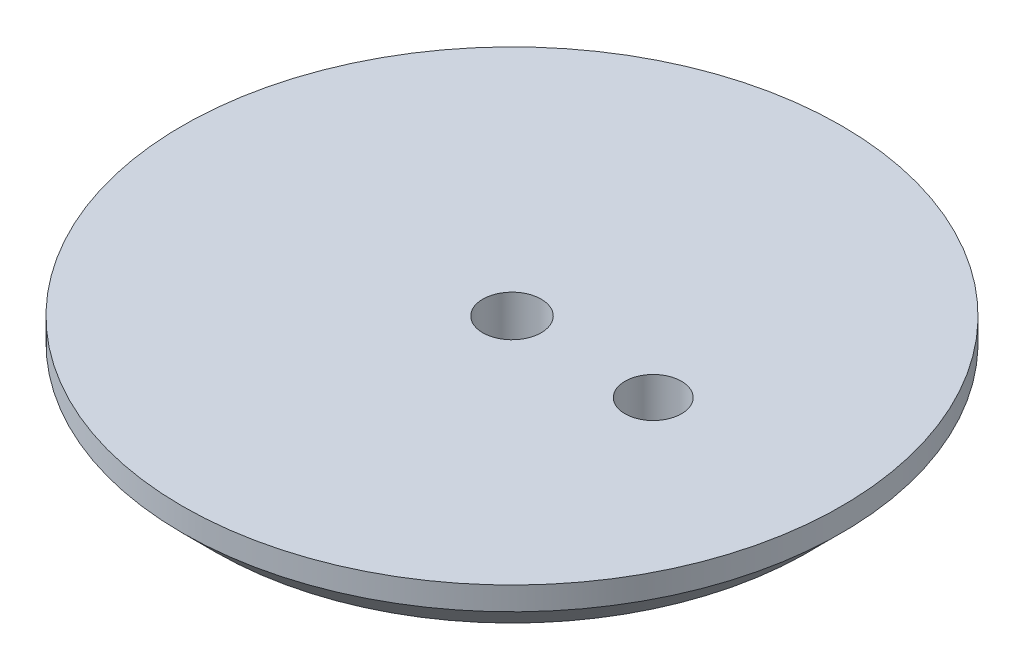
ISO-10303-21;
HEADER;
FILE_DESCRIPTION(('STEP AP214'),'2;1');
FILE_NAME('part.step','',(''),(''),'','','');
FILE_SCHEMA(('AUTOMOTIVE_DESIGN { 1 0 10303 214 1 1 1 1 }'));
ENDSEC;
DATA;
#1=APPLICATION_CONTEXT('core data for automotive mechanical design processes');
#2=APPLICATION_PROTOCOL_DEFINITION('international standard','automotive_design',2000,#1);
#3=PRODUCT_CONTEXT('',#1,'mechanical');
#4=PRODUCT('Part','Part','',(#3));
#5=PRODUCT_RELATED_PRODUCT_CATEGORY('part','',(#4));
#6=PRODUCT_DEFINITION_FORMATION('','',#4);
#7=PRODUCT_DEFINITION_CONTEXT('part definition',#1,'design');
#8=PRODUCT_DEFINITION('design','',#6,#7);
#9=PRODUCT_DEFINITION_SHAPE('','',#8);
#10=(LENGTH_UNIT() NAMED_UNIT(*) SI_UNIT(.MILLI.,.METRE.));
#11=(NAMED_UNIT(*) PLANE_ANGLE_UNIT() SI_UNIT($,.RADIAN.));
#12=(NAMED_UNIT(*) SI_UNIT($,.STERADIAN.) SOLID_ANGLE_UNIT());
#13=UNCERTAINTY_MEASURE_WITH_UNIT(LENGTH_MEASURE(1.E-05),#10,'distance_accuracy_value','');
#14=(GEOMETRIC_REPRESENTATION_CONTEXT(3) GLOBAL_UNCERTAINTY_ASSIGNED_CONTEXT((#13)) GLOBAL_UNIT_ASSIGNED_CONTEXT((#10,
#11,#12)) REPRESENTATION_CONTEXT('',''));
#15=CARTESIAN_POINT('',(0.,0.,0.));
#16=DIRECTION('',(0.,0.,1.));
#17=DIRECTION('',(1.,0.,0.));
#18=AXIS2_PLACEMENT_3D('',#15,#16,#17);
#19=CARTESIAN_POINT('',(0.,0.,0.));
#20=DIRECTION('',(0.,1.,0.));
#21=DIRECTION('',(0.,0.,1.));
#22=AXIS2_PLACEMENT_3D('',#19,#20,#21);
#23=PLANE('',#22);
#24=CARTESIAN_POINT('',(15.,0.,0.));
#25=DIRECTION('',(0.,1.,0.));
#26=DIRECTION('',(0.,0.,1.));
#27=AXIS2_PLACEMENT_3D('',#24,#25,#26);
#28=CIRCLE('',#27,3.);
#29=CARTESIAN_POINT('',(15.,0.,3.));
#30=VERTEX_POINT('',#29);
#31=EDGE_CURVE('E47',#30,#30,#28,.T.);
#32=ORIENTED_EDGE('',*,*,#31,.T.);
#33=EDGE_LOOP('',(#32));
#34=FACE_BOUND('',#33,.T.);
#35=CARTESIAN_POINT('',(0.,0.,0.));
#36=DIRECTION('',(0.,1.,0.));
#37=DIRECTION('',(0.,0.,1.));
#38=AXIS2_PLACEMENT_3D('',#35,#36,#37);
#39=CIRCLE('',#38,3.1);
#40=CARTESIAN_POINT('',(0.,0.,3.1));
#41=VERTEX_POINT('',#40);
#42=EDGE_CURVE('E39',#41,#41,#39,.T.);
#43=ORIENTED_EDGE('',*,*,#42,.T.);
#44=EDGE_LOOP('',(#43));
#45=FACE_BOUND('',#44,.T.);
#46=CARTESIAN_POINT('',(0.,0.,0.));
#47=DIRECTION('',(0.,1.,0.));
#48=DIRECTION('',(0.,0.,1.));
#49=AXIS2_PLACEMENT_3D('',#46,#47,#48);
#50=CIRCLE('',#49,31.4644660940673);
#51=CARTESIAN_POINT('',(0.,0.,31.4644660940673));
#52=VERTEX_POINT('',#51);
#53=EDGE_CURVE('E10',#52,#52,#50,.T.);
#54=ORIENTED_EDGE('',*,*,#53,.F.);
#55=EDGE_LOOP('',(#54));
#56=FACE_BOUND('',#55,.T.);
#57=ADVANCED_FACE('F25',(#34,#45,#56),#23,.F.);
#58=CARTESIAN_POINT('',(0.,0.,0.));
#59=DIRECTION('',(0.,1.,0.));
#60=DIRECTION('',(0.,0.,1.));
#61=AXIS2_PLACEMENT_3D('',#58,#59,#60);
#62=CONICAL_SURFACE('',#61,31.4644660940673,0.785398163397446);
#63=CARTESIAN_POINT('',(0.,3.53553390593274,0.));
#64=DIRECTION('',(0.,1.,0.));
#65=DIRECTION('',(0.,0.,1.));
#66=AXIS2_PLACEMENT_3D('',#63,#64,#65);
#67=CIRCLE('',#66,35.);
#68=CARTESIAN_POINT('',(0.,3.53553390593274,35.));
#69=VERTEX_POINT('',#68);
#70=EDGE_CURVE('E31',#69,#69,#67,.T.);
#71=ORIENTED_EDGE('',*,*,#70,.F.);
#72=EDGE_LOOP('',(#71));
#73=FACE_BOUND('',#72,.T.);
#74=ORIENTED_EDGE('',*,*,#53,.T.);
#75=EDGE_LOOP('',(#74));
#76=FACE_BOUND('',#75,.T.);
#77=ADVANCED_FACE('F68',(#73,#76),#62,.T.);
#78=CARTESIAN_POINT('',(0.,18.0759168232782,0.));
#79=DIRECTION('',(0.,1.,0.));
#80=DIRECTION('',(0.,0.,1.));
#81=AXIS2_PLACEMENT_3D('',#78,#79,#80);
#82=CYLINDRICAL_SURFACE('',#81,35.);
#83=CARTESIAN_POINT('',(0.,5.99999999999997,0.));
#84=DIRECTION('',(0.,1.,0.));
#85=DIRECTION('',(0.,0.,1.));
#86=AXIS2_PLACEMENT_3D('',#83,#84,#85);
#87=CIRCLE('',#86,35.);
#88=CARTESIAN_POINT('',(0.,5.99999999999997,35.));
#89=VERTEX_POINT('',#88);
#90=EDGE_CURVE('E35',#89,#89,#87,.T.);
#91=ORIENTED_EDGE('',*,*,#90,.F.);
#92=EDGE_LOOP('',(#91));
#93=FACE_BOUND('',#92,.T.);
#94=ORIENTED_EDGE('',*,*,#70,.T.);
#95=EDGE_LOOP('',(#94));
#96=FACE_BOUND('',#95,.T.);
#97=ADVANCED_FACE('F61',(#93,#96),#82,.T.);
#98=CARTESIAN_POINT('',(35.,5.9999999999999,0.));
#99=DIRECTION('',(0.,-1.,0.));
#100=DIRECTION('',(0.,0.,-1.));
#101=AXIS2_PLACEMENT_3D('',#98,#99,#100);
#102=PLANE('',#101);
#103=CARTESIAN_POINT('',(15.,5.9999999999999,0.));
#104=DIRECTION('',(0.,1.,0.));
#105=DIRECTION('',(0.,0.,1.));
#106=AXIS2_PLACEMENT_3D('',#103,#104,#105);
#107=CIRCLE('',#106,3.);
#108=CARTESIAN_POINT('',(15.,5.9999999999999,3.));
#109=VERTEX_POINT('',#108);
#110=EDGE_CURVE('E50',#109,#109,#107,.T.);
#111=ORIENTED_EDGE('',*,*,#110,.F.);
#112=EDGE_LOOP('',(#111));
#113=FACE_BOUND('',#112,.T.);
#114=CARTESIAN_POINT('',(0.,5.9999999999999,0.));
#115=DIRECTION('',(0.,1.,0.));
#116=DIRECTION('',(0.,0.,1.));
#117=AXIS2_PLACEMENT_3D('',#114,#115,#116);
#118=CIRCLE('',#117,3.1);
#119=CARTESIAN_POINT('',(0.,5.9999999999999,3.1));
#120=VERTEX_POINT('',#119);
#121=EDGE_CURVE('E44',#120,#120,#118,.T.);
#122=ORIENTED_EDGE('',*,*,#121,.F.);
#123=EDGE_LOOP('',(#122));
#124=FACE_BOUND('',#123,.T.);
#125=ORIENTED_EDGE('',*,*,#90,.T.);
#126=EDGE_LOOP('',(#125));
#127=FACE_BOUND('',#126,.T.);
#128=ADVANCED_FACE('F57',(#113,#124,#127),#102,.F.);
#129=CARTESIAN_POINT('',(0.,0.,0.));
#130=DIRECTION('',(0.,1.,0.));
#131=DIRECTION('',(0.,0.,1.));
#132=AXIS2_PLACEMENT_3D('',#129,#130,#131);
#133=CYLINDRICAL_SURFACE('',#132,3.1);
#134=ORIENTED_EDGE('',*,*,#42,.F.);
#135=EDGE_LOOP('',(#134));
#136=FACE_BOUND('',#135,.T.);
#137=ORIENTED_EDGE('',*,*,#121,.T.);
#138=EDGE_LOOP('',(#137));
#139=FACE_BOUND('',#138,.T.);
#140=ADVANCED_FACE('F60',(#136,#139),#133,.F.);
#141=CARTESIAN_POINT('',(15.,-4.0000000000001,0.));
#142=DIRECTION('',(0.,1.,0.));
#143=DIRECTION('',(0.,0.,1.));
#144=AXIS2_PLACEMENT_3D('',#141,#142,#143);
#145=CYLINDRICAL_SURFACE('',#144,3.);
#146=ORIENTED_EDGE('',*,*,#110,.T.);
#147=EDGE_LOOP('',(#146));
#148=FACE_BOUND('',#147,.T.);
#149=ORIENTED_EDGE('',*,*,#31,.F.);
#150=EDGE_LOOP('',(#149));
#151=FACE_BOUND('',#150,.T.);
#152=ADVANCED_FACE('F54',(#148,#151),#145,.F.);
#153=CLOSED_SHELL('',(#57,#77,#97,#128,#140,#152));
#154=MANIFOLD_SOLID_BREP('B2',#153);
#155=ADVANCED_BREP_SHAPE_REPRESENTATION('',(#18,#154),#14);
#156=SHAPE_DEFINITION_REPRESENTATION(#9,#155);
ENDSEC;
END-ISO-10303-21;
